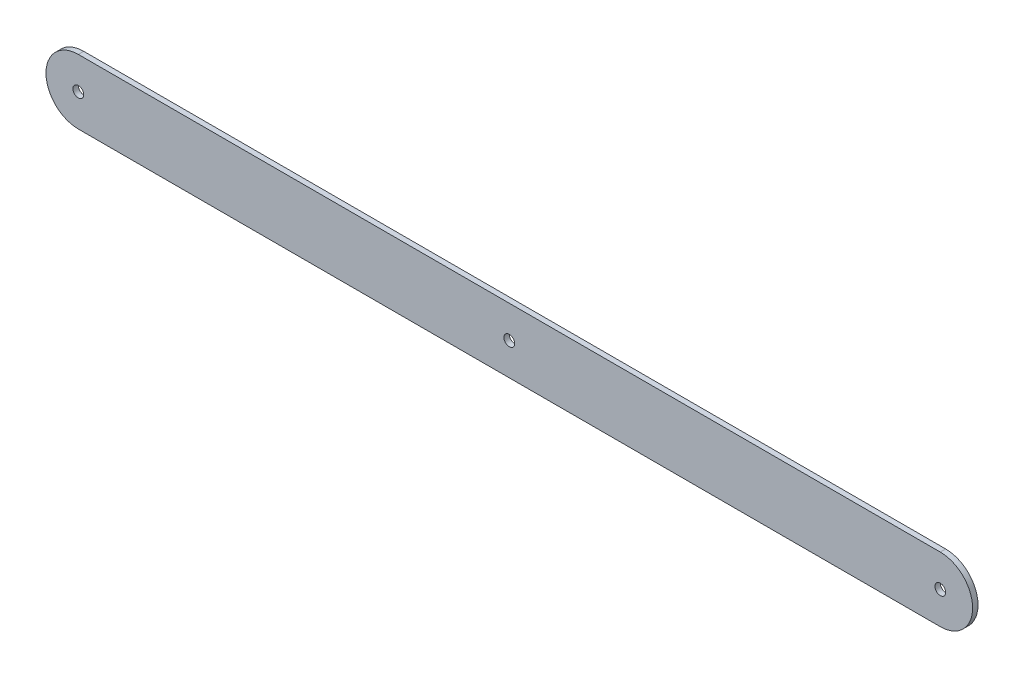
ISO-10303-21;
HEADER;
FILE_DESCRIPTION(('STEP AP214'),'2;1');
FILE_NAME('part.step','',(''),(''),'','','');
FILE_SCHEMA(('AUTOMOTIVE_DESIGN { 1 0 10303 214 1 1 1 1 }'));
ENDSEC;
DATA;
#1=APPLICATION_CONTEXT('core data for automotive mechanical design processes');
#2=APPLICATION_PROTOCOL_DEFINITION('international standard','automotive_design',2000,#1);
#3=PRODUCT_CONTEXT('',#1,'mechanical');
#4=PRODUCT('Part','Part','',(#3));
#5=PRODUCT_RELATED_PRODUCT_CATEGORY('part','',(#4));
#6=PRODUCT_DEFINITION_FORMATION('','',#4);
#7=PRODUCT_DEFINITION_CONTEXT('part definition',#1,'design');
#8=PRODUCT_DEFINITION('design','',#6,#7);
#9=PRODUCT_DEFINITION_SHAPE('','',#8);
#10=(LENGTH_UNIT() NAMED_UNIT(*) SI_UNIT(.MILLI.,.METRE.));
#11=(NAMED_UNIT(*) PLANE_ANGLE_UNIT() SI_UNIT($,.RADIAN.));
#12=(NAMED_UNIT(*) SI_UNIT($,.STERADIAN.) SOLID_ANGLE_UNIT());
#13=UNCERTAINTY_MEASURE_WITH_UNIT(LENGTH_MEASURE(1.E-05),#10,'distance_accuracy_value','');
#14=(GEOMETRIC_REPRESENTATION_CONTEXT(3) GLOBAL_UNCERTAINTY_ASSIGNED_CONTEXT((#13)) GLOBAL_UNIT_ASSIGNED_CONTEXT((#10,
#11,#12)) REPRESENTATION_CONTEXT('',''));
#15=CARTESIAN_POINT('',(0.,0.,0.));
#16=DIRECTION('',(0.,0.,1.));
#17=DIRECTION('',(1.,0.,0.));
#18=AXIS2_PLACEMENT_3D('',#15,#16,#17);
#19=CARTESIAN_POINT('',(0.,0.,1.));
#20=DIRECTION('',(0.,0.,1.));
#21=DIRECTION('',(1.,0.,0.));
#22=AXIS2_PLACEMENT_3D('',#19,#20,#21);
#23=PLANE('',#22);
#24=CARTESIAN_POINT('',(0.,0.,1.));
#25=DIRECTION('',(0.,0.,1.));
#26=DIRECTION('',(1.,0.,0.));
#27=AXIS2_PLACEMENT_3D('',#24,#25,#26);
#28=CIRCLE('',#27,1.);
#29=CARTESIAN_POINT('',(1.,0.,1.));
#30=VERTEX_POINT('',#29);
#31=EDGE_CURVE('E121',#30,#30,#28,.T.);
#32=ORIENTED_EDGE('',*,*,#31,.F.);
#33=EDGE_LOOP('',(#32));
#34=FACE_BOUND('',#33,.T.);
#35=CARTESIAN_POINT('',(160.,0.,1.));
#36=DIRECTION('',(0.,0.,1.));
#37=DIRECTION('',(1.,0.,0.));
#38=AXIS2_PLACEMENT_3D('',#35,#36,#37);
#39=CIRCLE('',#38,0.999999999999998);
#40=CARTESIAN_POINT('',(161.,0.,1.));
#41=VERTEX_POINT('',#40);
#42=EDGE_CURVE('E124',#41,#41,#39,.T.);
#43=ORIENTED_EDGE('',*,*,#42,.F.);
#44=EDGE_LOOP('',(#43));
#45=FACE_BOUND('',#44,.T.);
#46=CARTESIAN_POINT('',(0.,0.,1.));
#47=DIRECTION('',(0.,0.,1.));
#48=DIRECTION('',(1.,0.,0.));
#49=AXIS2_PLACEMENT_3D('',#46,#47,#48);
#50=CIRCLE('',#49,6.00000000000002);
#51=CARTESIAN_POINT('',(0.,6.00000000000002,1.));
#52=VERTEX_POINT('',#51);
#53=CARTESIAN_POINT('',(0.,-6.00000000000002,1.));
#54=VERTEX_POINT('',#53);
#55=EDGE_CURVE('E91',#52,#54,#50,.T.);
#56=ORIENTED_EDGE('',*,*,#55,.T.);
#57=DIRECTION('',(1.,0.,0.));
#58=VECTOR('',#57,1.);
#59=CARTESIAN_POINT('',(0.,-6.00000000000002,1.));
#60=LINE('',#59,#58);
#61=CARTESIAN_POINT('',(160.,-6.00000000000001,1.));
#62=VERTEX_POINT('',#61);
#63=EDGE_CURVE('E86',#54,#62,#60,.T.);
#64=ORIENTED_EDGE('',*,*,#63,.T.);
#65=CARTESIAN_POINT('',(160.,0.,1.));
#66=DIRECTION('',(0.,0.,1.));
#67=DIRECTION('',(1.,0.,0.));
#68=AXIS2_PLACEMENT_3D('',#65,#66,#67);
#69=CIRCLE('',#68,6.00000000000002);
#70=CARTESIAN_POINT('',(160.,6.00000000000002,1.));
#71=VERTEX_POINT('',#70);
#72=EDGE_CURVE('E89',#62,#71,#69,.T.);
#73=ORIENTED_EDGE('',*,*,#72,.T.);
#74=DIRECTION('',(-1.,0.,0.));
#75=VECTOR('',#74,1.);
#76=CARTESIAN_POINT('',(0.,6.00000000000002,1.));
#77=LINE('',#76,#75);
#78=EDGE_CURVE('E56',#71,#52,#77,.T.);
#79=ORIENTED_EDGE('',*,*,#78,.T.);
#80=EDGE_LOOP('',(#56,#64,#73,#79));
#81=FACE_BOUND('',#80,.T.);
#82=CARTESIAN_POINT('',(80.,0.,1.));
#83=DIRECTION('',(0.,0.,1.));
#84=DIRECTION('',(1.,0.,0.));
#85=AXIS2_PLACEMENT_3D('',#82,#83,#84);
#86=CIRCLE('',#85,0.999999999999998);
#87=CARTESIAN_POINT('',(81.,0.,1.));
#88=VERTEX_POINT('',#87);
#89=EDGE_CURVE('E106',#88,#88,#86,.T.);
#90=ORIENTED_EDGE('',*,*,#89,.F.);
#91=EDGE_LOOP('',(#90));
#92=FACE_BOUND('',#91,.T.);
#93=ADVANCED_FACE('F39',(#34,#45,#81,#92),#23,.T.);
#94=CARTESIAN_POINT('',(0.,0.,0.));
#95=DIRECTION('',(0.,0.,1.));
#96=DIRECTION('',(1.,0.,0.));
#97=AXIS2_PLACEMENT_3D('',#94,#95,#96);
#98=PLANE('',#97);
#99=CARTESIAN_POINT('',(0.,0.,0.));
#100=DIRECTION('',(0.,0.,1.));
#101=DIRECTION('',(1.,0.,0.));
#102=AXIS2_PLACEMENT_3D('',#99,#100,#101);
#103=CIRCLE('',#102,1.);
#104=CARTESIAN_POINT('',(1.,0.,0.));
#105=VERTEX_POINT('',#104);
#106=EDGE_CURVE('E130',#105,#105,#103,.T.);
#107=ORIENTED_EDGE('',*,*,#106,.T.);
#108=EDGE_LOOP('',(#107));
#109=FACE_BOUND('',#108,.T.);
#110=CARTESIAN_POINT('',(160.,0.,0.));
#111=DIRECTION('',(0.,0.,1.));
#112=DIRECTION('',(1.,0.,0.));
#113=AXIS2_PLACEMENT_3D('',#110,#111,#112);
#114=CIRCLE('',#113,0.999999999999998);
#115=CARTESIAN_POINT('',(161.,0.,0.));
#116=VERTEX_POINT('',#115);
#117=EDGE_CURVE('E127',#116,#116,#114,.T.);
#118=ORIENTED_EDGE('',*,*,#117,.T.);
#119=EDGE_LOOP('',(#118));
#120=FACE_BOUND('',#119,.T.);
#121=CARTESIAN_POINT('',(0.,0.,0.));
#122=DIRECTION('',(0.,0.,1.));
#123=DIRECTION('',(1.,0.,0.));
#124=AXIS2_PLACEMENT_3D('',#121,#122,#123);
#125=CIRCLE('',#124,6.00000000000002);
#126=CARTESIAN_POINT('',(0.,6.00000000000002,0.));
#127=VERTEX_POINT('',#126);
#128=CARTESIAN_POINT('',(0.,-6.00000000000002,0.));
#129=VERTEX_POINT('',#128);
#130=EDGE_CURVE('E103',#127,#129,#125,.T.);
#131=ORIENTED_EDGE('',*,*,#130,.F.);
#132=DIRECTION('',(-1.,0.,0.));
#133=VECTOR('',#132,1.);
#134=CARTESIAN_POINT('',(0.,6.00000000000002,0.));
#135=LINE('',#134,#133);
#136=CARTESIAN_POINT('',(160.,6.00000000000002,0.));
#137=VERTEX_POINT('',#136);
#138=EDGE_CURVE('E79',#137,#127,#135,.T.);
#139=ORIENTED_EDGE('',*,*,#138,.F.);
#140=CARTESIAN_POINT('',(160.,0.,0.));
#141=DIRECTION('',(0.,0.,1.));
#142=DIRECTION('',(1.,0.,0.));
#143=AXIS2_PLACEMENT_3D('',#140,#141,#142);
#144=CIRCLE('',#143,6.00000000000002);
#145=CARTESIAN_POINT('',(160.,-6.00000000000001,0.));
#146=VERTEX_POINT('',#145);
#147=EDGE_CURVE('E73',#146,#137,#144,.T.);
#148=ORIENTED_EDGE('',*,*,#147,.F.);
#149=DIRECTION('',(1.,0.,0.));
#150=VECTOR('',#149,1.);
#151=CARTESIAN_POINT('',(0.,-6.00000000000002,0.));
#152=LINE('',#151,#150);
#153=EDGE_CURVE('E95',#129,#146,#152,.T.);
#154=ORIENTED_EDGE('',*,*,#153,.F.);
#155=EDGE_LOOP('',(#131,#139,#148,#154));
#156=FACE_BOUND('',#155,.T.);
#157=CARTESIAN_POINT('',(80.,0.,0.));
#158=DIRECTION('',(0.,0.,1.));
#159=DIRECTION('',(1.,0.,0.));
#160=AXIS2_PLACEMENT_3D('',#157,#158,#159);
#161=CIRCLE('',#160,0.999999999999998);
#162=CARTESIAN_POINT('',(81.,0.,0.));
#163=VERTEX_POINT('',#162);
#164=EDGE_CURVE('E118',#163,#163,#161,.T.);
#165=ORIENTED_EDGE('',*,*,#164,.T.);
#166=EDGE_LOOP('',(#165));
#167=FACE_BOUND('',#166,.T.);
#168=ADVANCED_FACE('F114',(#109,#120,#156,#167),#98,.F.);
#169=CARTESIAN_POINT('',(0.,0.,1.));
#170=DIRECTION('',(0.,0.,-1.));
#171=DIRECTION('',(-1.,0.,0.));
#172=AXIS2_PLACEMENT_3D('',#169,#170,#171);
#173=CYLINDRICAL_SURFACE('',#172,6.00000000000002);
#174=ORIENTED_EDGE('',*,*,#130,.T.);
#175=DIRECTION('',(0.,0.,-1.));
#176=VECTOR('',#175,1.);
#177=CARTESIAN_POINT('',(0.,-6.00000000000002,1.));
#178=LINE('',#177,#176);
#179=EDGE_CURVE('E11',#54,#129,#178,.T.);
#180=ORIENTED_EDGE('',*,*,#179,.F.);
#181=ORIENTED_EDGE('',*,*,#55,.F.);
#182=DIRECTION('',(0.,0.,-1.));
#183=VECTOR('',#182,1.);
#184=CARTESIAN_POINT('',(0.,6.00000000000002,1.));
#185=LINE('',#184,#183);
#186=EDGE_CURVE('E99',#52,#127,#185,.T.);
#187=ORIENTED_EDGE('',*,*,#186,.T.);
#188=EDGE_LOOP('',(#174,#180,#181,#187));
#189=FACE_BOUND('',#188,.T.);
#190=ADVANCED_FACE('F41',(#189),#173,.T.);
#191=CARTESIAN_POINT('',(0.,-6.00000000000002,1.));
#192=DIRECTION('',(0.,1.,0.));
#193=DIRECTION('',(0.,0.,1.));
#194=AXIS2_PLACEMENT_3D('',#191,#192,#193);
#195=PLANE('',#194);
#196=ORIENTED_EDGE('',*,*,#153,.T.);
#197=DIRECTION('',(0.,0.,-1.));
#198=VECTOR('',#197,1.);
#199=CARTESIAN_POINT('',(160.,-6.00000000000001,1.));
#200=LINE('',#199,#198);
#201=EDGE_CURVE('E48',#62,#146,#200,.T.);
#202=ORIENTED_EDGE('',*,*,#201,.F.);
#203=ORIENTED_EDGE('',*,*,#63,.F.);
#204=ORIENTED_EDGE('',*,*,#179,.T.);
#205=EDGE_LOOP('',(#196,#202,#203,#204));
#206=FACE_BOUND('',#205,.T.);
#207=ADVANCED_FACE('F94',(#206),#195,.F.);
#208=CARTESIAN_POINT('',(160.,0.,1.));
#209=DIRECTION('',(0.,0.,-1.));
#210=DIRECTION('',(-1.,0.,0.));
#211=AXIS2_PLACEMENT_3D('',#208,#209,#210);
#212=CYLINDRICAL_SURFACE('',#211,6.00000000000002);
#213=ORIENTED_EDGE('',*,*,#147,.T.);
#214=DIRECTION('',(0.,0.,-1.));
#215=VECTOR('',#214,1.);
#216=CARTESIAN_POINT('',(160.,6.00000000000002,1.));
#217=LINE('',#216,#215);
#218=EDGE_CURVE('E96',#71,#137,#217,.T.);
#219=ORIENTED_EDGE('',*,*,#218,.F.);
#220=ORIENTED_EDGE('',*,*,#72,.F.);
#221=ORIENTED_EDGE('',*,*,#201,.T.);
#222=EDGE_LOOP('',(#213,#219,#220,#221));
#223=FACE_BOUND('',#222,.T.);
#224=ADVANCED_FACE('F97',(#223),#212,.T.);
#225=CARTESIAN_POINT('',(0.,6.00000000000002,1.));
#226=DIRECTION('',(0.,-1.,0.));
#227=DIRECTION('',(0.,0.,-1.));
#228=AXIS2_PLACEMENT_3D('',#225,#226,#227);
#229=PLANE('',#228);
#230=ORIENTED_EDGE('',*,*,#138,.T.);
#231=ORIENTED_EDGE('',*,*,#186,.F.);
#232=ORIENTED_EDGE('',*,*,#78,.F.);
#233=ORIENTED_EDGE('',*,*,#218,.T.);
#234=EDGE_LOOP('',(#230,#231,#232,#233));
#235=FACE_BOUND('',#234,.T.);
#236=ADVANCED_FACE('F111',(#235),#229,.F.);
#237=CARTESIAN_POINT('',(80.,0.,1.));
#238=DIRECTION('',(0.,0.,-1.));
#239=DIRECTION('',(-1.,0.,0.));
#240=AXIS2_PLACEMENT_3D('',#237,#238,#239);
#241=CYLINDRICAL_SURFACE('',#240,0.999999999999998);
#242=ORIENTED_EDGE('',*,*,#89,.T.);
#243=EDGE_LOOP('',(#242));
#244=FACE_BOUND('',#243,.T.);
#245=ORIENTED_EDGE('',*,*,#164,.F.);
#246=EDGE_LOOP('',(#245));
#247=FACE_BOUND('',#246,.T.);
#248=ADVANCED_FACE('F147',(#244,#247),#241,.F.);
#249=CARTESIAN_POINT('',(160.,0.,1.));
#250=DIRECTION('',(0.,0.,-1.));
#251=DIRECTION('',(-1.,0.,0.));
#252=AXIS2_PLACEMENT_3D('',#249,#250,#251);
#253=CYLINDRICAL_SURFACE('',#252,0.999999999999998);
#254=ORIENTED_EDGE('',*,*,#42,.T.);
#255=EDGE_LOOP('',(#254));
#256=FACE_BOUND('',#255,.T.);
#257=ORIENTED_EDGE('',*,*,#117,.F.);
#258=EDGE_LOOP('',(#257));
#259=FACE_BOUND('',#258,.T.);
#260=ADVANCED_FACE('F144',(#256,#259),#253,.F.);
#261=CARTESIAN_POINT('',(0.,0.,1.));
#262=DIRECTION('',(0.,0.,-1.));
#263=DIRECTION('',(-1.,0.,0.));
#264=AXIS2_PLACEMENT_3D('',#261,#262,#263);
#265=CYLINDRICAL_SURFACE('',#264,1.);
#266=ORIENTED_EDGE('',*,*,#31,.T.);
#267=EDGE_LOOP('',(#266));
#268=FACE_BOUND('',#267,.T.);
#269=ORIENTED_EDGE('',*,*,#106,.F.);
#270=EDGE_LOOP('',(#269));
#271=FACE_BOUND('',#270,.T.);
#272=ADVANCED_FACE('F136',(#268,#271),#265,.F.);
#273=CLOSED_SHELL('',(#93,#168,#190,#207,#224,#236,#248,#260,#272));
#274=MANIFOLD_SOLID_BREP('B2',#273);
#275=ADVANCED_BREP_SHAPE_REPRESENTATION('',(#18,#274),#14);
#276=SHAPE_DEFINITION_REPRESENTATION(#9,#275);
ENDSEC;
END-ISO-10303-21;
